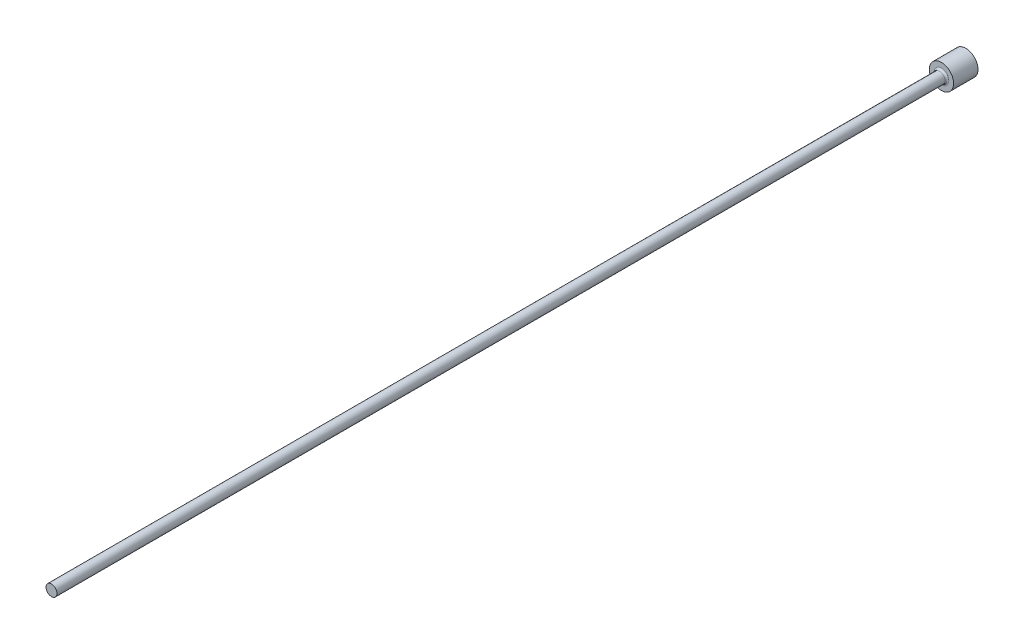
from build123d import *

# Parameters (mm, degrees)
FILLET1_R = 0.3


with BuildPart() as part:
    # FV → Revolve1 (revolve)
    with BuildSketch(Plane(origin=(0, 0, 0), x_dir=(1, 0, 0), z_dir=(0, 1, 0)), mode=Mode.PRIVATE) as revolve1_sk:
        Polygon((0, 0), (2, 0), (2, -4), (0.9, -4), (0.9, -150), (0, -150), align=None)
    revolve(revolve1_sk.sketch.rotate(Axis((0, 0, -9.033228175), (0, 0, 1)), 180), axis=Axis((0, 0, -9.033228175), (0, 0, 1)))

    # Fillet1
    fillet1_edges = [part.edges().sort_by_distance(p)[0] for p in [
        (0.9, 0, 4),
    ]]
    fillet(fillet1_edges, radius=FILLET1_R)


solid = part.part
